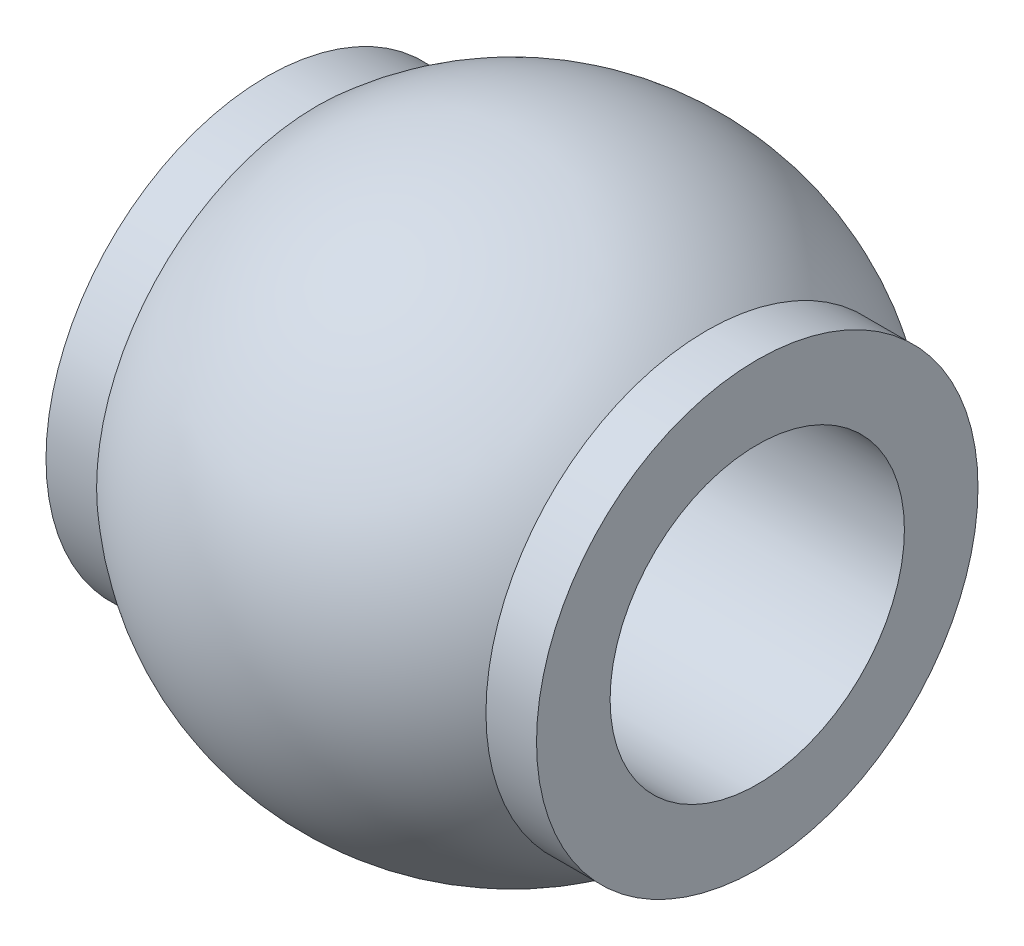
from build123d import *

# Parameters (mm, degrees)
ESQUISSE2_R             = 1.5
ENL_V_MAT_EXTRU_1_DEPTH = 7.557438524


with BuildPart() as part:
    # Esquisse1 → Base-R_volution (revolve)
    with BuildSketch(Plane.XY, mode=Mode.PRIVATE) as base_r_volution_sk:
        with BuildLine():
            Line((1.984313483, 2.25), (2.5, 2.25))
            Line((2.5, 2.25), (2.5, 0))
            Line((2.5, 0), (-2.5, 0))
            Line((-2.5, 0), (-2.5, 2.25))
            Line((-2.5, 2.25), (-1.984313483, 2.25))
            ThreePointArc((-1.984313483, 2.25), (0, 3), (1.984313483, 2.25))
        make_face()
    revolve(base_r_volution_sk.sketch.rotate(Axis((-3.639835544, 0, 0), (1, 0, 0)), 90), axis=Axis((-3.639835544, 0, 0), (1, 0, 0)))

    # Esquisse2 → Enl_v. mat.-Extru.1 (cut, through all)
    with BuildSketch(Plane(origin=(2.5, 0, 0), x_dir=(0, 0, -1), z_dir=(1, 0, 0))):
        Circle(ESQUISSE2_R)
    extrude(amount=-ENL_V_MAT_EXTRU_1_DEPTH, mode=Mode.SUBTRACT)


solid = part.part
